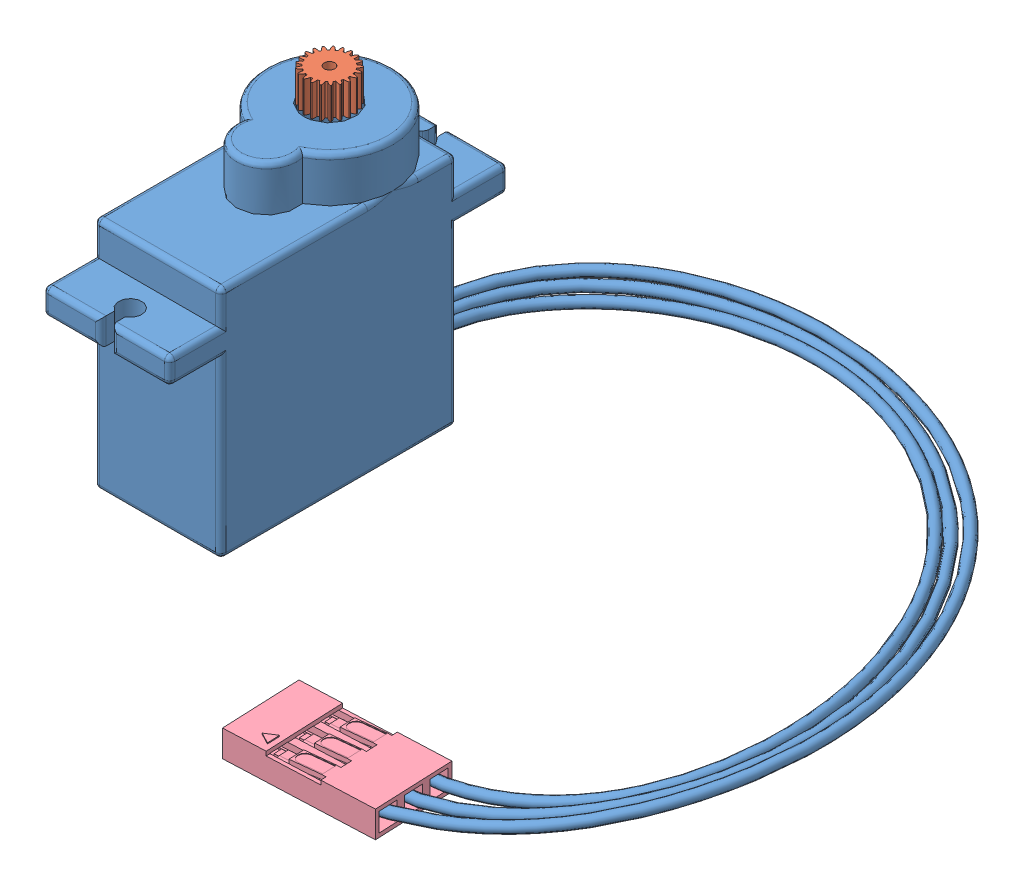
SolidWorks assembly Fitec FS90R_Micro Servo.SLDASM, configuration По умолчанию (file format 15000). Lengths in mm.
Overall size (60.72 29.7 63.64).
4 component instances, 4 part files, 8 mates.
Components (placement in the parent):
- FS90R_Housing-1: FS90R_Housing.SLDPRT [По умолчанию] at origin size (60.62 26.74 62.41)
- spur gear_din_0.2M 21T 21PA 3FW-1: spur gear_din_0.2M 21T 21PA 3FW.sldprt [DIN - Spur gear 0.2M 21T 20PA 3FW ---S21A75H50L1N] at (0 18.5 -5.15) x (0 -1 0) z (0 0 1) size (3 4.58 4.59)
- Label-1: Label.SLDPRT [По умолчанию] at (-6.05 -2.125 0) x (0 0 1) z (-1 0 0) size (20 11.25 0.1)
- BLS-3 by Dmitry Levin.step-1: BLS-3 by Dmitry Levin.step.SLDPRT [По умолчанию] at (22.3749 -9.93 26.2122) x (-0.042483 0 -0.999097) z (0.999097 0 -0.042483) size (7.62 2.64 14)
Mates (geometry in assembly coordinates):
- Концентричный1: concentric anti-aligned: cylinder of FS90R_Housing-1 through (0 15.5 -5.15) axis (0 -1 0) radius 2.43; cylinder of spur gear_din-1 through (0 -31.5001 -5.15) axis (0 1 0) radius 0.5
- Совпадение1: coincident anti-aligned: plane of FS90R_Housing-1 through (0 15.5 0) normal (0 1 0); plane of spur gear_din-1 through (0 15.5 -5.15) normal (0 -1 0)
- Совпадение3: coincident anti-aligned: plane of FS90R_Housing-1 through (-6.05 0 0) normal (-1 0 0); plane of Label-1 through (-6.05 -2.125 0) normal (1 0 0)
- Ширина1: width anti-aligned: plane of Label-1 through (-6.15 3.5 10) normal (0 0 1); plane of Label-1 through (-6.15 3.5 -10) normal (0 0 -1); plane of FS90R_Housing-1 through (6.05 11.2 -11.25) normal (0 0 -1); plane of FS90R_Housing-1 through (6.05 11.2 11.25) normal (0 0 1)
- Расстояние2: distance = 2 mm anti-aligned: plane of Label-1 through (-6.15 3.5 -10) normal (0 1 0); plane of FS90R_Housing-1 through (-6.05 5.5 16.15) normal (0 -1 0)
- Концентричный2: concentric anti-aligned: circle of FS90R_Housing-1; cylinder of BLS-3 by Dmitry Levin.step-1 through (32.9493 -9.93 20.678) axis (0.999097 0 -0.042483) radius 0.7
- Концентричный5: concentric aligned: circle of FS90R_Housing-1; circle of BLS-3.step-1
- Расстояние4: distance = 1 mm anti-aligned: plane of BLS-3 Dmitry Levin.step-1 through (34.7557 -9.93 23.1434) normal (0.999097 0 -0.042483); plane of FS90R_Housing-1 through (33.7566 -9.93 23.1859) normal (-0.999097 0 0.042483)
